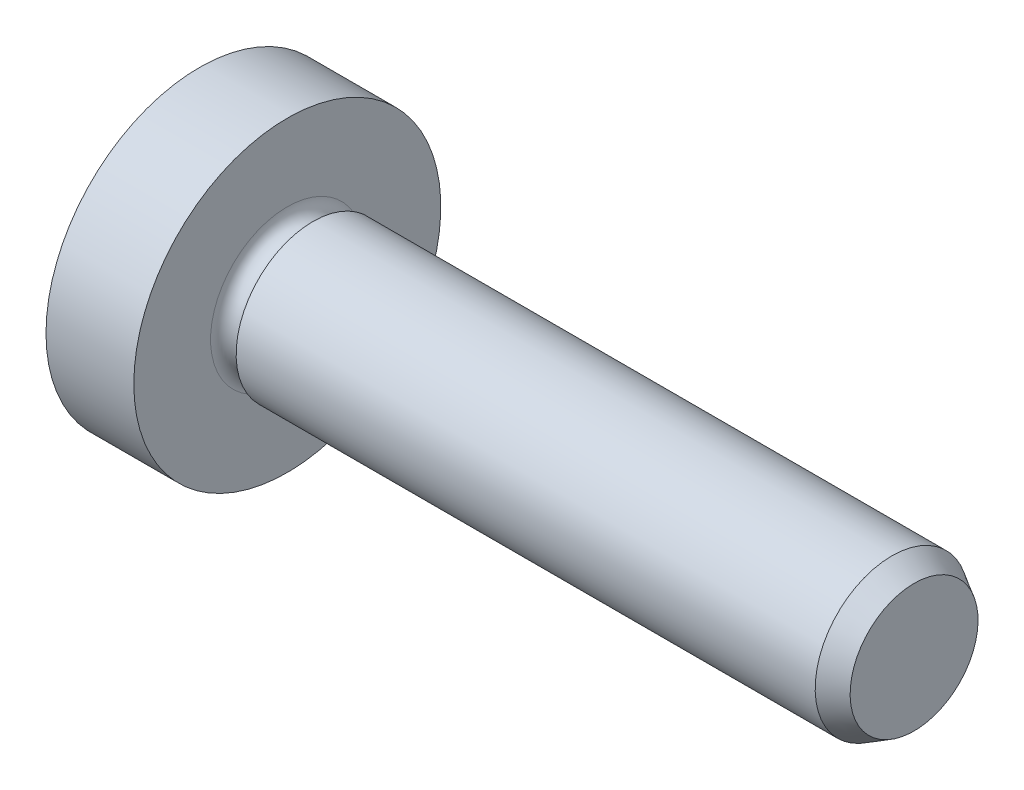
from build123d import *

# Parameters (mm, degrees)
CROSSRECESS_DEPTH = 3.1
DRAFT1_ANGLE      = -30


with BuildPart() as part:
    # Sketch1 → Base (revolve)
    with BuildSketch(Plane.XY, mode=Mode.PRIVATE) as base_sk:
        with BuildLine():
            Line((29.1, 0), (29.1, 3))
            Line((29.1, 3), (4.6, 3))
            Line((4.6, 3), (4.6, 6))
            Line((4.6, 6), (1.167603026, 6))
            ThreePointArc((1.167603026, 6), (0.29461316, 3.056276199), (0, 0))
            Line((0, 0), (29.1, 0))
        make_face()
    revolve(base_sk.sketch.rotate(Axis((-96.385195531, 0, 0), (1, 0, 0)), 90), axis=Axis((-96.385195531, 0, 0), (1, 0, 0)))

    # Sketch2 → CrossRecess (cut)
    with BuildSketch(Plane(origin=(0, 0, 0), x_dir=(0, 0, -1), z_dir=(1, 0, 0))):
        Polygon((-0.69, 3.45), (0.69, 3.45), (0.69, 0.69), (3.45, 0.69), (3.45, -0.69), (0.69, -0.69), (0.69, -3.45), (-0.69, -3.45), (-0.69, -0.69), (-3.45, -0.69), (-3.45, 0.69), (-0.69, 0.69), align=None)
    extrude(amount=CROSSRECESS_DEPTH, mode=Mode.SUBTRACT)

    # Draft1
    draft1_faces = [part.faces().sort_by_distance(p)[0] for p in [
        (1.7407264, 0, 3.45),
        (1.7407264, 3.45, 0),
        (1.7407264, 0, -3.45),
        (1.7407264, -3.45, 0),
    ]]
    draft(draft1_faces, Plane(origin=(0, 0, 0), x_dir=(0, 0, 1), z_dir=(1, 0, 0)), DRAFT1_ANGLE)

    # Sketch6 → BaseEnd (revolve, cut)
    with BuildSketch(Plane.XY, mode=Mode.PRIVATE) as baseend_sk:
        Polygon((28.233974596, -3), (29.1, -2.5), (29.1, -3), align=None)
    revolve(baseend_sk.sketch.rotate(Axis((30.948266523, 0, 0), (-1, 0, 0)), 180), axis=Axis((30.948266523, 0, 0), (-1, 0, 0)), mode=Mode.SUBTRACT)

    # Sketch4 → Cut-Revolve2 (revolve, cut)
    with BuildSketch(Plane(origin=(0, 0, 0), x_dir=(1, 0, 0), z_dir=(0, 1, 0)), mode=Mode.PRIVATE) as cut_revolve2_sk:
        with BuildLine():
            Line((4.6, 3), (5.6, 3))
            ThreePointArc((5.6, 3), (5.1, 2.5), (4.6, 3))
        make_face()
    revolve(cut_revolve2_sk.sketch.rotate(Axis((14.876032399, 0, 0), (-1, 0, 0)), 281.990691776), axis=Axis((14.876032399, 0, 0), (-1, 0, 0)), mode=Mode.SUBTRACT)


solid = part.part
